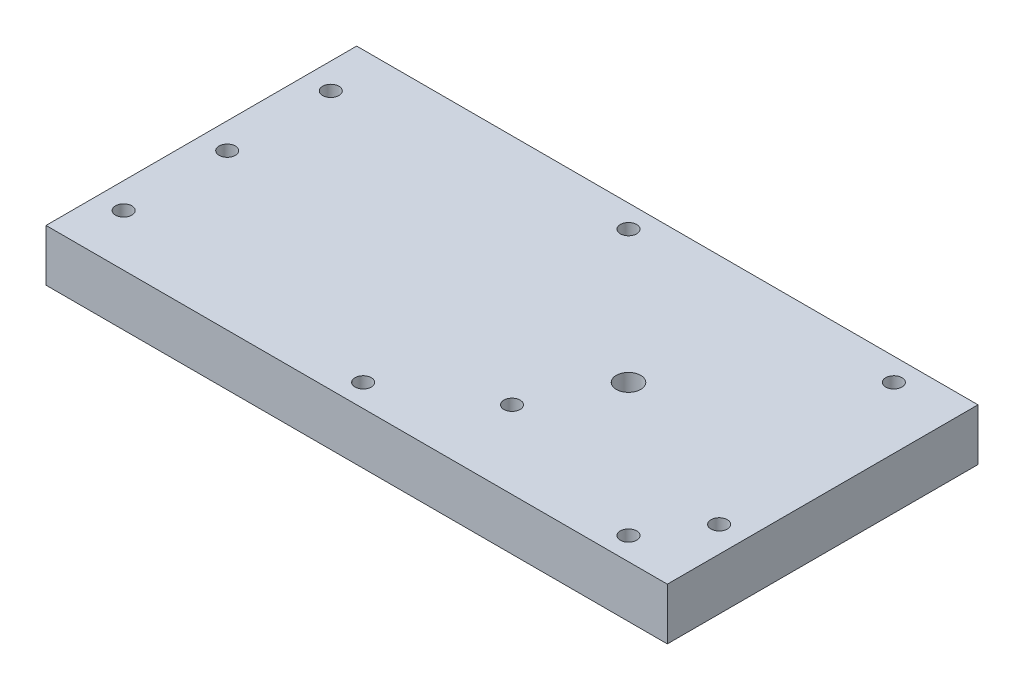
ISO-10303-21;
HEADER;
FILE_DESCRIPTION(('STEP AP214'),'2;1');
FILE_NAME('part.step','',(''),(''),'','','');
FILE_SCHEMA(('AUTOMOTIVE_DESIGN { 1 0 10303 214 1 1 1 1 }'));
ENDSEC;
DATA;
#1=APPLICATION_CONTEXT('core data for automotive mechanical design processes');
#2=APPLICATION_PROTOCOL_DEFINITION('international standard','automotive_design',2000,#1);
#3=PRODUCT_CONTEXT('',#1,'mechanical');
#4=PRODUCT('Part','Part','',(#3));
#5=PRODUCT_RELATED_PRODUCT_CATEGORY('part','',(#4));
#6=PRODUCT_DEFINITION_FORMATION('','',#4);
#7=PRODUCT_DEFINITION_CONTEXT('part definition',#1,'design');
#8=PRODUCT_DEFINITION('design','',#6,#7);
#9=PRODUCT_DEFINITION_SHAPE('','',#8);
#10=(LENGTH_UNIT() NAMED_UNIT(*) SI_UNIT(.MILLI.,.METRE.));
#11=(NAMED_UNIT(*) PLANE_ANGLE_UNIT() SI_UNIT($,.RADIAN.));
#12=(NAMED_UNIT(*) SI_UNIT($,.STERADIAN.) SOLID_ANGLE_UNIT());
#13=UNCERTAINTY_MEASURE_WITH_UNIT(LENGTH_MEASURE(1.E-05),#10,'distance_accuracy_value','');
#14=(GEOMETRIC_REPRESENTATION_CONTEXT(3) GLOBAL_UNCERTAINTY_ASSIGNED_CONTEXT((#13)) GLOBAL_UNIT_ASSIGNED_CONTEXT((#10,
#11,#12)) REPRESENTATION_CONTEXT('',''));
#15=CARTESIAN_POINT('',(0.,0.,0.));
#16=DIRECTION('',(0.,0.,1.));
#17=DIRECTION('',(1.,0.,0.));
#18=AXIS2_PLACEMENT_3D('',#15,#16,#17);
#19=CARTESIAN_POINT('',(-55.5846629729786,12.7,-16.3881833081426));
#20=DIRECTION('',(1.,0.,0.));
#21=DIRECTION('',(0.,0.,-1.));
#22=AXIS2_PLACEMENT_3D('',#19,#20,#21);
#23=PLANE('',#22);
#24=DIRECTION('',(0.,0.,1.));
#25=VECTOR('',#24,1.);
#26=CARTESIAN_POINT('',(-55.5846629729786,0.,-16.3881833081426));
#27=LINE('',#26,#25);
#28=CARTESIAN_POINT('',(-55.5846629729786,0.,-16.3881833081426));
#29=VERTEX_POINT('',#28);
#30=CARTESIAN_POINT('',(-55.5846629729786,0.,59.8118166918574));
#31=VERTEX_POINT('',#30);
#32=EDGE_CURVE('E96',#29,#31,#27,.T.);
#33=ORIENTED_EDGE('',*,*,#32,.T.);
#34=DIRECTION('',(0.,-1.,0.));
#35=VECTOR('',#34,1.);
#36=CARTESIAN_POINT('',(-55.5846629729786,12.7,59.8118166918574));
#37=LINE('',#36,#35);
#38=CARTESIAN_POINT('',(-55.5846629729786,12.7,59.8118166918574));
#39=VERTEX_POINT('',#38);
#40=EDGE_CURVE('E11',#39,#31,#37,.T.);
#41=ORIENTED_EDGE('',*,*,#40,.F.);
#42=DIRECTION('',(0.,0.,1.));
#43=VECTOR('',#42,1.);
#44=CARTESIAN_POINT('',(-55.5846629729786,12.7,-16.3881833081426));
#45=LINE('',#44,#43);
#46=CARTESIAN_POINT('',(-55.5846629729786,12.7,-16.3881833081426));
#47=VERTEX_POINT('',#46);
#48=EDGE_CURVE('E84',#47,#39,#45,.T.);
#49=ORIENTED_EDGE('',*,*,#48,.F.);
#50=DIRECTION('',(0.,-1.,0.));
#51=VECTOR('',#50,1.);
#52=CARTESIAN_POINT('',(-55.5846629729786,12.7,-16.3881833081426));
#53=LINE('',#52,#51);
#54=EDGE_CURVE('E92',#47,#29,#53,.T.);
#55=ORIENTED_EDGE('',*,*,#54,.T.);
#56=EDGE_LOOP('',(#33,#41,#49,#55));
#57=FACE_BOUND('',#56,.T.);
#58=ADVANCED_FACE('F33',(#57),#23,.F.);
#59=CARTESIAN_POINT('',(-55.5846629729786,12.7,59.8118166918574));
#60=DIRECTION('',(0.,0.,-1.));
#61=DIRECTION('',(-1.,0.,0.));
#62=AXIS2_PLACEMENT_3D('',#59,#60,#61);
#63=PLANE('',#62);
#64=DIRECTION('',(1.,0.,0.));
#65=VECTOR('',#64,1.);
#66=CARTESIAN_POINT('',(-55.5846629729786,0.,59.8118166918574));
#67=LINE('',#66,#65);
#68=CARTESIAN_POINT('',(96.8153370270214,0.,59.8118166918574));
#69=VERTEX_POINT('',#68);
#70=EDGE_CURVE('E88',#31,#69,#67,.T.);
#71=ORIENTED_EDGE('',*,*,#70,.T.);
#72=DIRECTION('',(0.,-1.,0.));
#73=VECTOR('',#72,1.);
#74=CARTESIAN_POINT('',(96.8153370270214,12.7,59.8118166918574));
#75=LINE('',#74,#73);
#76=CARTESIAN_POINT('',(96.8153370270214,12.7,59.8118166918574));
#77=VERTEX_POINT('',#76);
#78=EDGE_CURVE('E41',#77,#69,#75,.T.);
#79=ORIENTED_EDGE('',*,*,#78,.F.);
#80=DIRECTION('',(1.,0.,0.));
#81=VECTOR('',#80,1.);
#82=CARTESIAN_POINT('',(-55.5846629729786,12.7,59.8118166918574));
#83=LINE('',#82,#81);
#84=EDGE_CURVE('E79',#39,#77,#83,.T.);
#85=ORIENTED_EDGE('',*,*,#84,.F.);
#86=ORIENTED_EDGE('',*,*,#40,.T.);
#87=EDGE_LOOP('',(#71,#79,#85,#86));
#88=FACE_BOUND('',#87,.T.);
#89=ADVANCED_FACE('F87',(#88),#63,.F.);
#90=CARTESIAN_POINT('',(96.8153370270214,12.7,-16.3881833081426));
#91=DIRECTION('',(-1.,0.,0.));
#92=DIRECTION('',(0.,0.,1.));
#93=AXIS2_PLACEMENT_3D('',#90,#91,#92);
#94=PLANE('',#93);
#95=DIRECTION('',(0.,0.,-1.));
#96=VECTOR('',#95,1.);
#97=CARTESIAN_POINT('',(96.8153370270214,0.,-16.3881833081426));
#98=LINE('',#97,#96);
#99=CARTESIAN_POINT('',(96.8153370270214,0.,-16.3881833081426));
#100=VERTEX_POINT('',#99);
#101=EDGE_CURVE('E66',#69,#100,#98,.T.);
#102=ORIENTED_EDGE('',*,*,#101,.T.);
#103=DIRECTION('',(0.,-1.,0.));
#104=VECTOR('',#103,1.);
#105=CARTESIAN_POINT('',(96.8153370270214,12.7,-16.3881833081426));
#106=LINE('',#105,#104);
#107=CARTESIAN_POINT('',(96.8153370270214,12.7,-16.3881833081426));
#108=VERTEX_POINT('',#107);
#109=EDGE_CURVE('E89',#108,#100,#106,.T.);
#110=ORIENTED_EDGE('',*,*,#109,.F.);
#111=DIRECTION('',(0.,0.,-1.));
#112=VECTOR('',#111,1.);
#113=CARTESIAN_POINT('',(96.8153370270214,12.7,-16.3881833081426));
#114=LINE('',#113,#112);
#115=EDGE_CURVE('E82',#77,#108,#114,.T.);
#116=ORIENTED_EDGE('',*,*,#115,.F.);
#117=ORIENTED_EDGE('',*,*,#78,.T.);
#118=EDGE_LOOP('',(#102,#110,#116,#117));
#119=FACE_BOUND('',#118,.T.);
#120=ADVANCED_FACE('F90',(#119),#94,.F.);
#121=CARTESIAN_POINT('',(-55.5846629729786,12.7,-16.3881833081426));
#122=DIRECTION('',(0.,0.,1.));
#123=DIRECTION('',(1.,0.,0.));
#124=AXIS2_PLACEMENT_3D('',#121,#122,#123);
#125=PLANE('',#124);
#126=DIRECTION('',(-1.,0.,0.));
#127=VECTOR('',#126,1.);
#128=CARTESIAN_POINT('',(-55.5846629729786,0.,-16.3881833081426));
#129=LINE('',#128,#127);
#130=EDGE_CURVE('E72',#100,#29,#129,.T.);
#131=ORIENTED_EDGE('',*,*,#130,.T.);
#132=ORIENTED_EDGE('',*,*,#54,.F.);
#133=DIRECTION('',(-1.,0.,0.));
#134=VECTOR('',#133,1.);
#135=CARTESIAN_POINT('',(-55.5846629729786,12.7,-16.3881833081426));
#136=LINE('',#135,#134);
#137=EDGE_CURVE('E49',#108,#47,#136,.T.);
#138=ORIENTED_EDGE('',*,*,#137,.F.);
#139=ORIENTED_EDGE('',*,*,#109,.T.);
#140=EDGE_LOOP('',(#131,#132,#138,#139));
#141=FACE_BOUND('',#140,.T.);
#142=ADVANCED_FACE('F104',(#141),#125,.F.);
#143=CARTESIAN_POINT('',(-55.5846629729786,12.7,59.8118166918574));
#144=DIRECTION('',(0.,1.,0.));
#145=DIRECTION('',(0.,0.,1.));
#146=AXIS2_PLACEMENT_3D('',#143,#144,#145);
#147=PLANE('',#146);
#148=CARTESIAN_POINT('',(81.7340870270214,12.7,-10.8319333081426));
#149=DIRECTION('',(0.,1.,0.));
#150=DIRECTION('',(0.,0.,1.));
#151=AXIS2_PLACEMENT_3D('',#148,#149,#150);
#152=CIRCLE('',#151,2.);
#153=CARTESIAN_POINT('',(81.7340870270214,12.7,-8.83193330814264));
#154=VERTEX_POINT('',#153);
#155=EDGE_CURVE('E164',#154,#154,#152,.T.);
#156=ORIENTED_EDGE('',*,*,#155,.F.);
#157=EDGE_LOOP('',(#156));
#158=FACE_BOUND('',#157,.T.);
#159=CARTESIAN_POINT('',(81.7340870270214,12.7,54.2555666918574));
#160=DIRECTION('',(0.,1.,0.));
#161=DIRECTION('',(0.,0.,1.));
#162=AXIS2_PLACEMENT_3D('',#159,#160,#161);
#163=CIRCLE('',#162,2.);
#164=CARTESIAN_POINT('',(81.7340870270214,12.7,56.2555666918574));
#165=VERTEX_POINT('',#164);
#166=EDGE_CURVE('E158',#165,#165,#163,.T.);
#167=ORIENTED_EDGE('',*,*,#166,.F.);
#168=EDGE_LOOP('',(#167));
#169=FACE_BOUND('',#168,.T.);
#170=CARTESIAN_POINT('',(16.6465870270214,12.7,54.2555666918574));
#171=DIRECTION('',(0.,1.,0.));
#172=DIRECTION('',(0.,0.,1.));
#173=AXIS2_PLACEMENT_3D('',#170,#171,#172);
#174=CIRCLE('',#173,2.);
#175=CARTESIAN_POINT('',(16.6465870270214,12.7,56.2555666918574));
#176=VERTEX_POINT('',#175);
#177=EDGE_CURVE('E152',#176,#176,#174,.T.);
#178=ORIENTED_EDGE('',*,*,#177,.F.);
#179=EDGE_LOOP('',(#178));
#180=FACE_BOUND('',#179,.T.);
#181=CARTESIAN_POINT('',(16.6465870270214,12.7,-10.8319333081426));
#182=DIRECTION('',(0.,1.,0.));
#183=DIRECTION('',(0.,0.,1.));
#184=AXIS2_PLACEMENT_3D('',#181,#182,#183);
#185=CIRCLE('',#184,2.);
#186=CARTESIAN_POINT('',(16.6465870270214,12.7,-8.83193330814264));
#187=VERTEX_POINT('',#186);
#188=EDGE_CURVE('E146',#187,#187,#185,.T.);
#189=ORIENTED_EDGE('',*,*,#188,.F.);
#190=EDGE_LOOP('',(#189));
#191=FACE_BOUND('',#190,.T.);
#192=CARTESIAN_POINT('',(39.6653370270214,12.7,40.7618166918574));
#193=DIRECTION('',(0.,1.,0.));
#194=DIRECTION('',(0.,0.,1.));
#195=AXIS2_PLACEMENT_3D('',#192,#193,#194);
#196=CIRCLE('',#195,2.);
#197=CARTESIAN_POINT('',(39.6653370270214,12.7,42.7618166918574));
#198=VERTEX_POINT('',#197);
#199=EDGE_CURVE('E140',#198,#198,#196,.T.);
#200=ORIENTED_EDGE('',*,*,#199,.F.);
#201=EDGE_LOOP('',(#200));
#202=FACE_BOUND('',#201,.T.);
#203=CARTESIAN_POINT('',(90.4653370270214,12.7,40.7618166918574));
#204=DIRECTION('',(0.,1.,0.));
#205=DIRECTION('',(0.,0.,1.));
#206=AXIS2_PLACEMENT_3D('',#203,#204,#205);
#207=CIRCLE('',#206,2.);
#208=CARTESIAN_POINT('',(90.4653370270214,12.7,42.7618166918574));
#209=VERTEX_POINT('',#208);
#210=EDGE_CURVE('E134',#209,#209,#207,.T.);
#211=ORIENTED_EDGE('',*,*,#210,.F.);
#212=EDGE_LOOP('',(#211));
#213=FACE_BOUND('',#212,.T.);
#214=CARTESIAN_POINT('',(49.1903370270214,12.7,21.7118166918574));
#215=DIRECTION('',(0.,1.,0.));
#216=DIRECTION('',(0.,0.,1.));
#217=AXIS2_PLACEMENT_3D('',#214,#215,#216);
#218=CIRCLE('',#217,3.);
#219=CARTESIAN_POINT('',(49.1903370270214,12.7,24.7118166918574));
#220=VERTEX_POINT('',#219);
#221=EDGE_CURVE('E128',#220,#220,#218,.T.);
#222=ORIENTED_EDGE('',*,*,#221,.F.);
#223=EDGE_LOOP('',(#222));
#224=FACE_BOUND('',#223,.T.);
#225=CARTESIAN_POINT('',(-49.2346629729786,12.7,47.1118166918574));
#226=DIRECTION('',(0.,1.,0.));
#227=DIRECTION('',(0.,0.,1.));
#228=AXIS2_PLACEMENT_3D('',#225,#226,#227);
#229=CIRCLE('',#228,2.);
#230=CARTESIAN_POINT('',(-49.2346629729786,12.7,49.1118166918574));
#231=VERTEX_POINT('',#230);
#232=EDGE_CURVE('E122',#231,#231,#229,.T.);
#233=ORIENTED_EDGE('',*,*,#232,.F.);
#234=EDGE_LOOP('',(#233));
#235=FACE_BOUND('',#234,.T.);
#236=CARTESIAN_POINT('',(-49.2346629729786,12.7,21.7118166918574));
#237=DIRECTION('',(0.,1.,0.));
#238=DIRECTION('',(0.,0.,1.));
#239=AXIS2_PLACEMENT_3D('',#236,#237,#238);
#240=CIRCLE('',#239,2.);
#241=CARTESIAN_POINT('',(-49.2346629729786,12.7,23.7118166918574));
#242=VERTEX_POINT('',#241);
#243=EDGE_CURVE('E116',#242,#242,#240,.T.);
#244=ORIENTED_EDGE('',*,*,#243,.F.);
#245=EDGE_LOOP('',(#244));
#246=FACE_BOUND('',#245,.T.);
#247=CARTESIAN_POINT('',(-49.2346629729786,12.7,-3.68818330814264));
#248=DIRECTION('',(0.,1.,0.));
#249=DIRECTION('',(0.,0.,1.));
#250=AXIS2_PLACEMENT_3D('',#247,#248,#249);
#251=CIRCLE('',#250,2.);
#252=CARTESIAN_POINT('',(-49.2346629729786,12.7,-1.68818330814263));
#253=VERTEX_POINT('',#252);
#254=EDGE_CURVE('E110',#253,#253,#251,.T.);
#255=ORIENTED_EDGE('',*,*,#254,.F.);
#256=EDGE_LOOP('',(#255));
#257=FACE_BOUND('',#256,.T.);
#258=ORIENTED_EDGE('',*,*,#48,.T.);
#259=ORIENTED_EDGE('',*,*,#84,.T.);
#260=ORIENTED_EDGE('',*,*,#115,.T.);
#261=ORIENTED_EDGE('',*,*,#137,.T.);
#262=EDGE_LOOP('',(#258,#259,#260,#261));
#263=FACE_BOUND('',#262,.T.);
#264=ADVANCED_FACE('F80',(#158,#169,#180,#191,#202,#213,#224,#235,#246,#257,#263),#147,.T.);
#265=CARTESIAN_POINT('',(-55.5846629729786,0.,59.8118166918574));
#266=DIRECTION('',(0.,1.,0.));
#267=DIRECTION('',(0.,0.,1.));
#268=AXIS2_PLACEMENT_3D('',#265,#266,#267);
#269=PLANE('',#268);
#270=CARTESIAN_POINT('',(39.6653370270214,0.,40.7618166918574));
#271=DIRECTION('',(0.,1.,0.));
#272=DIRECTION('',(0.,0.,1.));
#273=AXIS2_PLACEMENT_3D('',#270,#271,#272);
#274=CIRCLE('',#273,2.);
#275=CARTESIAN_POINT('',(39.6653370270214,0.,42.7618166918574));
#276=VERTEX_POINT('',#275);
#277=EDGE_CURVE('E137',#276,#276,#274,.T.);
#278=ORIENTED_EDGE('',*,*,#277,.T.);
#279=EDGE_LOOP('',(#278));
#280=FACE_BOUND('',#279,.T.);
#281=CARTESIAN_POINT('',(90.4653370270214,0.,40.7618166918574));
#282=DIRECTION('',(0.,1.,0.));
#283=DIRECTION('',(0.,0.,1.));
#284=AXIS2_PLACEMENT_3D('',#281,#282,#283);
#285=CIRCLE('',#284,2.);
#286=CARTESIAN_POINT('',(90.4653370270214,0.,42.7618166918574));
#287=VERTEX_POINT('',#286);
#288=EDGE_CURVE('E131',#287,#287,#285,.T.);
#289=ORIENTED_EDGE('',*,*,#288,.T.);
#290=EDGE_LOOP('',(#289));
#291=FACE_BOUND('',#290,.T.);
#292=CARTESIAN_POINT('',(49.1903370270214,0.,21.7118166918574));
#293=DIRECTION('',(0.,1.,0.));
#294=DIRECTION('',(0.,0.,1.));
#295=AXIS2_PLACEMENT_3D('',#292,#293,#294);
#296=CIRCLE('',#295,3.);
#297=CARTESIAN_POINT('',(49.1903370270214,0.,24.7118166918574));
#298=VERTEX_POINT('',#297);
#299=EDGE_CURVE('E125',#298,#298,#296,.T.);
#300=ORIENTED_EDGE('',*,*,#299,.T.);
#301=EDGE_LOOP('',(#300));
#302=FACE_BOUND('',#301,.T.);
#303=CARTESIAN_POINT('',(-49.2346629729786,0.,47.1118166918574));
#304=DIRECTION('',(0.,1.,0.));
#305=DIRECTION('',(0.,0.,1.));
#306=AXIS2_PLACEMENT_3D('',#303,#304,#305);
#307=CIRCLE('',#306,2.);
#308=CARTESIAN_POINT('',(-49.2346629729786,0.,49.1118166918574));
#309=VERTEX_POINT('',#308);
#310=EDGE_CURVE('E119',#309,#309,#307,.T.);
#311=ORIENTED_EDGE('',*,*,#310,.T.);
#312=EDGE_LOOP('',(#311));
#313=FACE_BOUND('',#312,.T.);
#314=CARTESIAN_POINT('',(-49.2346629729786,0.,21.7118166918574));
#315=DIRECTION('',(0.,1.,0.));
#316=DIRECTION('',(0.,0.,1.));
#317=AXIS2_PLACEMENT_3D('',#314,#315,#316);
#318=CIRCLE('',#317,2.);
#319=CARTESIAN_POINT('',(-49.2346629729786,0.,23.7118166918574));
#320=VERTEX_POINT('',#319);
#321=EDGE_CURVE('E113',#320,#320,#318,.T.);
#322=ORIENTED_EDGE('',*,*,#321,.T.);
#323=EDGE_LOOP('',(#322));
#324=FACE_BOUND('',#323,.T.);
#325=CARTESIAN_POINT('',(-49.2346629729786,0.,-3.68818330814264));
#326=DIRECTION('',(0.,1.,0.));
#327=DIRECTION('',(0.,0.,1.));
#328=AXIS2_PLACEMENT_3D('',#325,#326,#327);
#329=CIRCLE('',#328,2.);
#330=CARTESIAN_POINT('',(-49.2346629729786,0.,-1.68818330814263));
#331=VERTEX_POINT('',#330);
#332=EDGE_CURVE('E99',#331,#331,#329,.T.);
#333=ORIENTED_EDGE('',*,*,#332,.T.);
#334=EDGE_LOOP('',(#333));
#335=FACE_BOUND('',#334,.T.);
#336=ORIENTED_EDGE('',*,*,#32,.F.);
#337=ORIENTED_EDGE('',*,*,#130,.F.);
#338=ORIENTED_EDGE('',*,*,#101,.F.);
#339=ORIENTED_EDGE('',*,*,#70,.F.);
#340=EDGE_LOOP('',(#336,#337,#338,#339));
#341=FACE_BOUND('',#340,.T.);
#342=ADVANCED_FACE('F107',(#280,#291,#302,#313,#324,#335,#341),#269,.F.);
#343=CARTESIAN_POINT('',(-49.2346629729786,0.,-3.68818330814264));
#344=DIRECTION('',(0.,1.,0.));
#345=DIRECTION('',(0.,0.,1.));
#346=AXIS2_PLACEMENT_3D('',#343,#344,#345);
#347=CYLINDRICAL_SURFACE('',#346,2.);
#348=ORIENTED_EDGE('',*,*,#332,.F.);
#349=EDGE_LOOP('',(#348));
#350=FACE_BOUND('',#349,.T.);
#351=ORIENTED_EDGE('',*,*,#254,.T.);
#352=EDGE_LOOP('',(#351));
#353=FACE_BOUND('',#352,.T.);
#354=ADVANCED_FACE('F200',(#350,#353),#347,.F.);
#355=CARTESIAN_POINT('',(-49.2346629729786,0.,21.7118166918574));
#356=DIRECTION('',(0.,1.,0.));
#357=DIRECTION('',(0.,0.,1.));
#358=AXIS2_PLACEMENT_3D('',#355,#356,#357);
#359=CYLINDRICAL_SURFACE('',#358,2.);
#360=ORIENTED_EDGE('',*,*,#321,.F.);
#361=EDGE_LOOP('',(#360));
#362=FACE_BOUND('',#361,.T.);
#363=ORIENTED_EDGE('',*,*,#243,.T.);
#364=EDGE_LOOP('',(#363));
#365=FACE_BOUND('',#364,.T.);
#366=ADVANCED_FACE('F202',(#362,#365),#359,.F.);
#367=CARTESIAN_POINT('',(-49.2346629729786,0.,47.1118166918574));
#368=DIRECTION('',(0.,1.,0.));
#369=DIRECTION('',(0.,0.,1.));
#370=AXIS2_PLACEMENT_3D('',#367,#368,#369);
#371=CYLINDRICAL_SURFACE('',#370,2.);
#372=ORIENTED_EDGE('',*,*,#310,.F.);
#373=EDGE_LOOP('',(#372));
#374=FACE_BOUND('',#373,.T.);
#375=ORIENTED_EDGE('',*,*,#232,.T.);
#376=EDGE_LOOP('',(#375));
#377=FACE_BOUND('',#376,.T.);
#378=ADVANCED_FACE('F209',(#374,#377),#371,.F.);
#379=CARTESIAN_POINT('',(49.1903370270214,0.,21.7118166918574));
#380=DIRECTION('',(0.,1.,0.));
#381=DIRECTION('',(0.,0.,1.));
#382=AXIS2_PLACEMENT_3D('',#379,#380,#381);
#383=CYLINDRICAL_SURFACE('',#382,3.);
#384=ORIENTED_EDGE('',*,*,#299,.F.);
#385=EDGE_LOOP('',(#384));
#386=FACE_BOUND('',#385,.T.);
#387=ORIENTED_EDGE('',*,*,#221,.T.);
#388=EDGE_LOOP('',(#387));
#389=FACE_BOUND('',#388,.T.);
#390=ADVANCED_FACE('F246',(#386,#389),#383,.F.);
#391=CARTESIAN_POINT('',(90.4653370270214,0.,40.7618166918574));
#392=DIRECTION('',(0.,1.,0.));
#393=DIRECTION('',(0.,0.,1.));
#394=AXIS2_PLACEMENT_3D('',#391,#392,#393);
#395=CYLINDRICAL_SURFACE('',#394,2.);
#396=ORIENTED_EDGE('',*,*,#288,.F.);
#397=EDGE_LOOP('',(#396));
#398=FACE_BOUND('',#397,.T.);
#399=ORIENTED_EDGE('',*,*,#210,.T.);
#400=EDGE_LOOP('',(#399));
#401=FACE_BOUND('',#400,.T.);
#402=ADVANCED_FACE('F251',(#398,#401),#395,.F.);
#403=CARTESIAN_POINT('',(39.6653370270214,0.,40.7618166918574));
#404=DIRECTION('',(0.,1.,0.));
#405=DIRECTION('',(0.,0.,1.));
#406=AXIS2_PLACEMENT_3D('',#403,#404,#405);
#407=CYLINDRICAL_SURFACE('',#406,2.);
#408=ORIENTED_EDGE('',*,*,#277,.F.);
#409=EDGE_LOOP('',(#408));
#410=FACE_BOUND('',#409,.T.);
#411=ORIENTED_EDGE('',*,*,#199,.T.);
#412=EDGE_LOOP('',(#411));
#413=FACE_BOUND('',#412,.T.);
#414=ADVANCED_FACE('F255',(#410,#413),#407,.F.);
#415=CARTESIAN_POINT('',(16.6465870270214,6.35,-10.8319333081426));
#416=DIRECTION('',(0.,1.,0.));
#417=DIRECTION('',(0.,0.,1.));
#418=AXIS2_PLACEMENT_3D('',#415,#416,#417);
#419=CYLINDRICAL_SURFACE('',#418,2.);
#420=CARTESIAN_POINT('',(16.6465870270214,6.35,-10.8319333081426));
#421=DIRECTION('',(0.,1.,0.));
#422=DIRECTION('',(0.,0.,1.));
#423=AXIS2_PLACEMENT_3D('',#420,#421,#422);
#424=CIRCLE('',#423,2.);
#425=CARTESIAN_POINT('',(16.6465870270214,6.35,-8.83193330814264));
#426=VERTEX_POINT('',#425);
#427=EDGE_CURVE('E143',#426,#426,#424,.T.);
#428=ORIENTED_EDGE('',*,*,#427,.F.);
#429=EDGE_LOOP('',(#428));
#430=FACE_BOUND('',#429,.T.);
#431=ORIENTED_EDGE('',*,*,#188,.T.);
#432=EDGE_LOOP('',(#431));
#433=FACE_BOUND('',#432,.T.);
#434=ADVANCED_FACE('F264',(#430,#433),#419,.F.);
#435=CARTESIAN_POINT('',(16.6465870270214,6.35,-10.8319333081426));
#436=DIRECTION('',(0.,1.,0.));
#437=DIRECTION('',(0.,0.,1.));
#438=AXIS2_PLACEMENT_3D('',#435,#436,#437);
#439=PLANE('',#438);
#440=ORIENTED_EDGE('',*,*,#427,.T.);
#441=EDGE_LOOP('',(#440));
#442=FACE_BOUND('',#441,.T.);
#443=ADVANCED_FACE('F274',(#442),#439,.T.);
#444=CARTESIAN_POINT('',(16.6465870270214,6.35,54.2555666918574));
#445=DIRECTION('',(0.,1.,0.));
#446=DIRECTION('',(0.,0.,1.));
#447=AXIS2_PLACEMENT_3D('',#444,#445,#446);
#448=CYLINDRICAL_SURFACE('',#447,2.);
#449=CARTESIAN_POINT('',(16.6465870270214,6.35,54.2555666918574));
#450=DIRECTION('',(0.,1.,0.));
#451=DIRECTION('',(0.,0.,1.));
#452=AXIS2_PLACEMENT_3D('',#449,#450,#451);
#453=CIRCLE('',#452,2.);
#454=CARTESIAN_POINT('',(16.6465870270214,6.35,56.2555666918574));
#455=VERTEX_POINT('',#454);
#456=EDGE_CURVE('E149',#455,#455,#453,.T.);
#457=ORIENTED_EDGE('',*,*,#456,.F.);
#458=EDGE_LOOP('',(#457));
#459=FACE_BOUND('',#458,.T.);
#460=ORIENTED_EDGE('',*,*,#177,.T.);
#461=EDGE_LOOP('',(#460));
#462=FACE_BOUND('',#461,.T.);
#463=ADVANCED_FACE('F281',(#459,#462),#448,.F.);
#464=CARTESIAN_POINT('',(16.6465870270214,6.35,54.2555666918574));
#465=DIRECTION('',(0.,1.,0.));
#466=DIRECTION('',(0.,0.,1.));
#467=AXIS2_PLACEMENT_3D('',#464,#465,#466);
#468=PLANE('',#467);
#469=ORIENTED_EDGE('',*,*,#456,.T.);
#470=EDGE_LOOP('',(#469));
#471=FACE_BOUND('',#470,.T.);
#472=ADVANCED_FACE('F289',(#471),#468,.T.);
#473=CARTESIAN_POINT('',(81.7340870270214,6.35,54.2555666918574));
#474=DIRECTION('',(0.,1.,0.));
#475=DIRECTION('',(0.,0.,1.));
#476=AXIS2_PLACEMENT_3D('',#473,#474,#475);
#477=CYLINDRICAL_SURFACE('',#476,2.);
#478=CARTESIAN_POINT('',(81.7340870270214,6.35,54.2555666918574));
#479=DIRECTION('',(0.,1.,0.));
#480=DIRECTION('',(0.,0.,1.));
#481=AXIS2_PLACEMENT_3D('',#478,#479,#480);
#482=CIRCLE('',#481,2.);
#483=CARTESIAN_POINT('',(81.7340870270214,6.35,56.2555666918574));
#484=VERTEX_POINT('',#483);
#485=EDGE_CURVE('E155',#484,#484,#482,.T.);
#486=ORIENTED_EDGE('',*,*,#485,.F.);
#487=EDGE_LOOP('',(#486));
#488=FACE_BOUND('',#487,.T.);
#489=ORIENTED_EDGE('',*,*,#166,.T.);
#490=EDGE_LOOP('',(#489));
#491=FACE_BOUND('',#490,.T.);
#492=ADVANCED_FACE('F297',(#488,#491),#477,.F.);
#493=CARTESIAN_POINT('',(81.7340870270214,6.35,54.2555666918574));
#494=DIRECTION('',(0.,1.,0.));
#495=DIRECTION('',(0.,0.,1.));
#496=AXIS2_PLACEMENT_3D('',#493,#494,#495);
#497=PLANE('',#496);
#498=ORIENTED_EDGE('',*,*,#485,.T.);
#499=EDGE_LOOP('',(#498));
#500=FACE_BOUND('',#499,.T.);
#501=ADVANCED_FACE('F175',(#500),#497,.T.);
#502=CARTESIAN_POINT('',(81.7340870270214,6.35,-10.8319333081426));
#503=DIRECTION('',(0.,1.,0.));
#504=DIRECTION('',(0.,0.,1.));
#505=AXIS2_PLACEMENT_3D('',#502,#503,#504);
#506=CYLINDRICAL_SURFACE('',#505,2.);
#507=CARTESIAN_POINT('',(81.7340870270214,6.35,-10.8319333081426));
#508=DIRECTION('',(0.,1.,0.));
#509=DIRECTION('',(0.,0.,1.));
#510=AXIS2_PLACEMENT_3D('',#507,#508,#509);
#511=CIRCLE('',#510,2.);
#512=CARTESIAN_POINT('',(81.7340870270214,6.35,-8.83193330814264));
#513=VERTEX_POINT('',#512);
#514=EDGE_CURVE('E161',#513,#513,#511,.T.);
#515=ORIENTED_EDGE('',*,*,#514,.F.);
#516=EDGE_LOOP('',(#515));
#517=FACE_BOUND('',#516,.T.);
#518=ORIENTED_EDGE('',*,*,#155,.T.);
#519=EDGE_LOOP('',(#518));
#520=FACE_BOUND('',#519,.T.);
#521=ADVANCED_FACE('F172',(#517,#520),#506,.F.);
#522=CARTESIAN_POINT('',(81.7340870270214,6.35,-10.8319333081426));
#523=DIRECTION('',(0.,1.,0.));
#524=DIRECTION('',(0.,0.,1.));
#525=AXIS2_PLACEMENT_3D('',#522,#523,#524);
#526=PLANE('',#525);
#527=ORIENTED_EDGE('',*,*,#514,.T.);
#528=EDGE_LOOP('',(#527));
#529=FACE_BOUND('',#528,.T.);
#530=ADVANCED_FACE('F170',(#529),#526,.T.);
#531=CLOSED_SHELL('',(#58,#89,#120,#142,#264,#342,#354,#366,#378,#390,#402,#414,#434,#443,#463,
#472,#492,#501,#521,#530));
#532=MANIFOLD_SOLID_BREP('B2',#531);
#533=ADVANCED_BREP_SHAPE_REPRESENTATION('',(#18,#532),#14);
#534=SHAPE_DEFINITION_REPRESENTATION(#9,#533);
ENDSEC;
END-ISO-10303-21;
